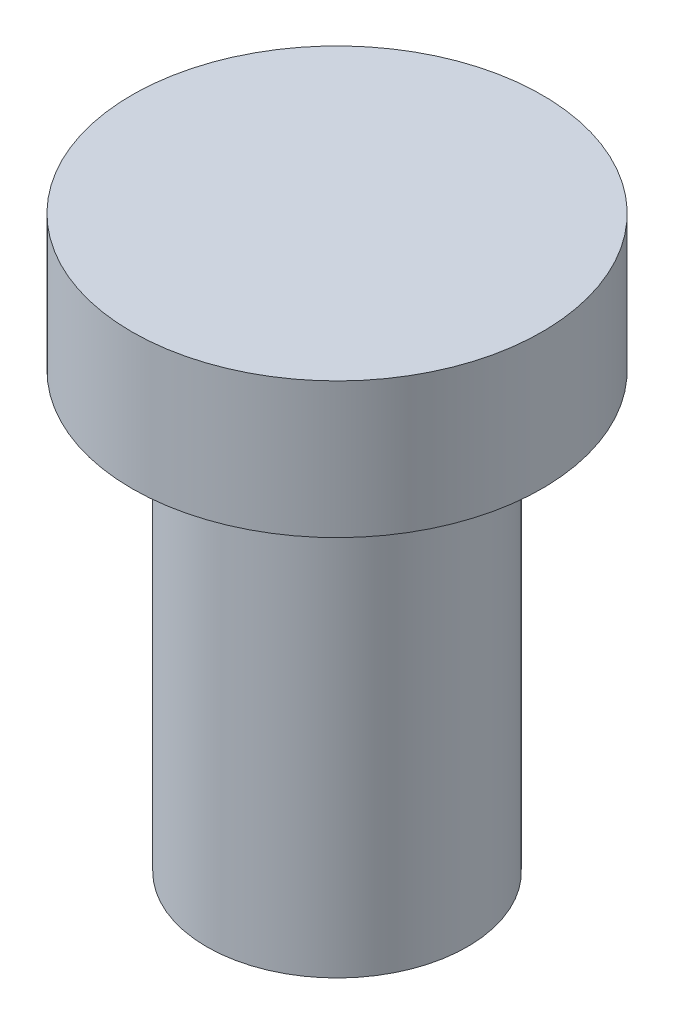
ISO-10303-21;
HEADER;
FILE_DESCRIPTION(('STEP AP214'),'2;1');
FILE_NAME('part.step','',(''),(''),'','','');
FILE_SCHEMA(('AUTOMOTIVE_DESIGN { 1 0 10303 214 1 1 1 1 }'));
ENDSEC;
DATA;
#1=APPLICATION_CONTEXT('core data for automotive mechanical design processes');
#2=APPLICATION_PROTOCOL_DEFINITION('international standard','automotive_design',2000,#1);
#3=PRODUCT_CONTEXT('',#1,'mechanical');
#4=PRODUCT('Part','Part','',(#3));
#5=PRODUCT_RELATED_PRODUCT_CATEGORY('part','',(#4));
#6=PRODUCT_DEFINITION_FORMATION('','',#4);
#7=PRODUCT_DEFINITION_CONTEXT('part definition',#1,'design');
#8=PRODUCT_DEFINITION('design','',#6,#7);
#9=PRODUCT_DEFINITION_SHAPE('','',#8);
#10=(LENGTH_UNIT() NAMED_UNIT(*) SI_UNIT(.MILLI.,.METRE.));
#11=(NAMED_UNIT(*) PLANE_ANGLE_UNIT() SI_UNIT($,.RADIAN.));
#12=(NAMED_UNIT(*) SI_UNIT($,.STERADIAN.) SOLID_ANGLE_UNIT());
#13=UNCERTAINTY_MEASURE_WITH_UNIT(LENGTH_MEASURE(1.E-05),#10,'distance_accuracy_value','');
#14=(GEOMETRIC_REPRESENTATION_CONTEXT(3) GLOBAL_UNCERTAINTY_ASSIGNED_CONTEXT((#13)) GLOBAL_UNIT_ASSIGNED_CONTEXT((#10,
#11,#12)) REPRESENTATION_CONTEXT('',''));
#15=CARTESIAN_POINT('',(0.,0.,0.));
#16=DIRECTION('',(0.,0.,1.));
#17=DIRECTION('',(1.,0.,0.));
#18=AXIS2_PLACEMENT_3D('',#15,#16,#17);
#19=CARTESIAN_POINT('',(0.,10.16,0.));
#20=DIRECTION('',(0.,-1.,0.));
#21=DIRECTION('',(0.,0.,-1.));
#22=AXIS2_PLACEMENT_3D('',#19,#20,#21);
#23=CYLINDRICAL_SURFACE('',#22,3.05);
#24=CARTESIAN_POINT('',(0.,10.16,0.));
#25=DIRECTION('',(0.,1.,0.));
#26=DIRECTION('',(0.,0.,1.));
#27=AXIS2_PLACEMENT_3D('',#24,#25,#26);
#28=CIRCLE('',#27,3.05);
#29=CARTESIAN_POINT('',(0.,10.16,3.05));
#30=VERTEX_POINT('',#29);
#31=EDGE_CURVE('E10',#30,#30,#28,.T.);
#32=ORIENTED_EDGE('',*,*,#31,.F.);
#33=EDGE_LOOP('',(#32));
#34=FACE_BOUND('',#33,.T.);
#35=CARTESIAN_POINT('',(0.,0.,0.));
#36=DIRECTION('',(0.,1.,0.));
#37=DIRECTION('',(0.,0.,1.));
#38=AXIS2_PLACEMENT_3D('',#35,#36,#37);
#39=CIRCLE('',#38,3.05);
#40=CARTESIAN_POINT('',(0.,0.,3.05));
#41=VERTEX_POINT('',#40);
#42=EDGE_CURVE('E37',#41,#41,#39,.T.);
#43=ORIENTED_EDGE('',*,*,#42,.T.);
#44=EDGE_LOOP('',(#43));
#45=FACE_BOUND('',#44,.T.);
#46=ADVANCED_FACE('F31',(#34,#45),#23,.T.);
#47=CARTESIAN_POINT('',(0.,0.,0.));
#48=DIRECTION('',(0.,1.,0.));
#49=DIRECTION('',(0.,0.,1.));
#50=AXIS2_PLACEMENT_3D('',#47,#48,#49);
#51=PLANE('',#50);
#52=ORIENTED_EDGE('',*,*,#42,.F.);
#53=EDGE_LOOP('',(#52));
#54=FACE_BOUND('',#53,.T.);
#55=ADVANCED_FACE('F55',(#54),#51,.F.);
#56=CARTESIAN_POINT('',(0.,10.16,0.));
#57=DIRECTION('',(0.,1.,0.));
#58=DIRECTION('',(0.,0.,1.));
#59=AXIS2_PLACEMENT_3D('',#56,#57,#58);
#60=PLANE('',#59);
#61=CARTESIAN_POINT('',(0.,10.16,0.));
#62=DIRECTION('',(0.,1.,0.));
#63=DIRECTION('',(0.,0.,1.));
#64=AXIS2_PLACEMENT_3D('',#61,#62,#63);
#65=CIRCLE('',#64,4.79993768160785);
#66=CARTESIAN_POINT('',(0.,10.16,4.79993768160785));
#67=VERTEX_POINT('',#66);
#68=EDGE_CURVE('E45',#67,#67,#65,.T.);
#69=ORIENTED_EDGE('',*,*,#68,.F.);
#70=EDGE_LOOP('',(#69));
#71=FACE_BOUND('',#70,.T.);
#72=ORIENTED_EDGE('',*,*,#31,.T.);
#73=EDGE_LOOP('',(#72));
#74=FACE_BOUND('',#73,.T.);
#75=ADVANCED_FACE('F53',(#71,#74),#60,.F.);
#76=CARTESIAN_POINT('',(0.,13.335,0.));
#77=DIRECTION('',(0.,-1.,0.));
#78=DIRECTION('',(0.,0.,-1.));
#79=AXIS2_PLACEMENT_3D('',#76,#77,#78);
#80=CYLINDRICAL_SURFACE('',#79,4.79993768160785);
#81=CARTESIAN_POINT('',(0.,13.335,0.));
#82=DIRECTION('',(0.,1.,0.));
#83=DIRECTION('',(0.,0.,1.));
#84=AXIS2_PLACEMENT_3D('',#81,#82,#83);
#85=CIRCLE('',#84,4.79993768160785);
#86=CARTESIAN_POINT('',(0.,13.335,4.79993768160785));
#87=VERTEX_POINT('',#86);
#88=EDGE_CURVE('E41',#87,#87,#85,.T.);
#89=ORIENTED_EDGE('',*,*,#88,.F.);
#90=EDGE_LOOP('',(#89));
#91=FACE_BOUND('',#90,.T.);
#92=ORIENTED_EDGE('',*,*,#68,.T.);
#93=EDGE_LOOP('',(#92));
#94=FACE_BOUND('',#93,.T.);
#95=ADVANCED_FACE('F51',(#91,#94),#80,.T.);
#96=CARTESIAN_POINT('',(0.,13.335,0.));
#97=DIRECTION('',(0.,1.,0.));
#98=DIRECTION('',(0.,0.,1.));
#99=AXIS2_PLACEMENT_3D('',#96,#97,#98);
#100=PLANE('',#99);
#101=ORIENTED_EDGE('',*,*,#88,.T.);
#102=EDGE_LOOP('',(#101));
#103=FACE_BOUND('',#102,.T.);
#104=ADVANCED_FACE('F61',(#103),#100,.T.);
#105=CLOSED_SHELL('',(#46,#55,#75,#95,#104));
#106=MANIFOLD_SOLID_BREP('B2',#105);
#107=ADVANCED_BREP_SHAPE_REPRESENTATION('',(#18,#106),#14);
#108=SHAPE_DEFINITION_REPRESENTATION(#9,#107);
ENDSEC;
END-ISO-10303-21;
